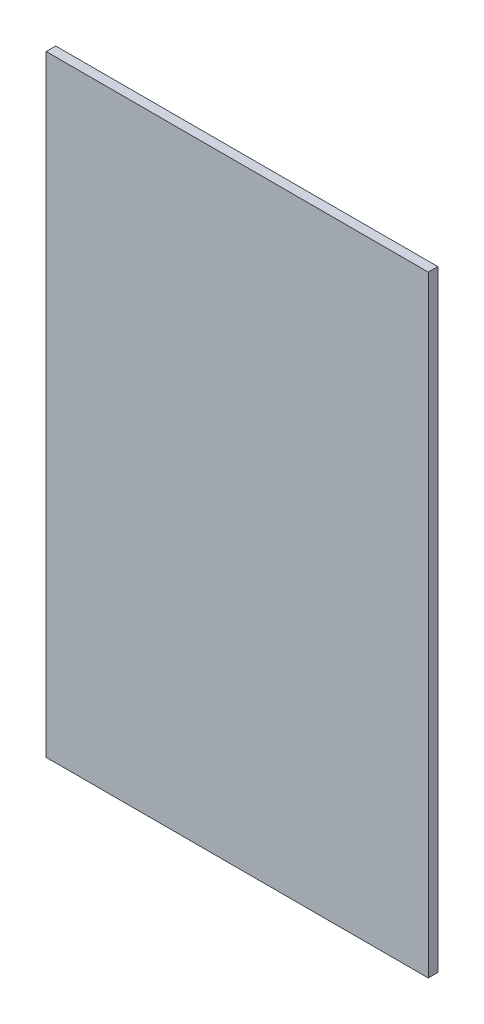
from build123d import *

# Parameters (mm, degrees)
SKETCH1_W           = 254
SKETCH1_H           = 406.4
BOSS_EXTRUDE1_DEPTH = 6.35


with BuildPart() as part:
    # Sketch1 → Boss-Extrude1 (new body)
    with BuildSketch(Plane.XY):
        with Locations((127, 203.2)):
            Rectangle(SKETCH1_W, SKETCH1_H)
    extrude(amount=BOSS_EXTRUDE1_DEPTH)


solid = part.part
